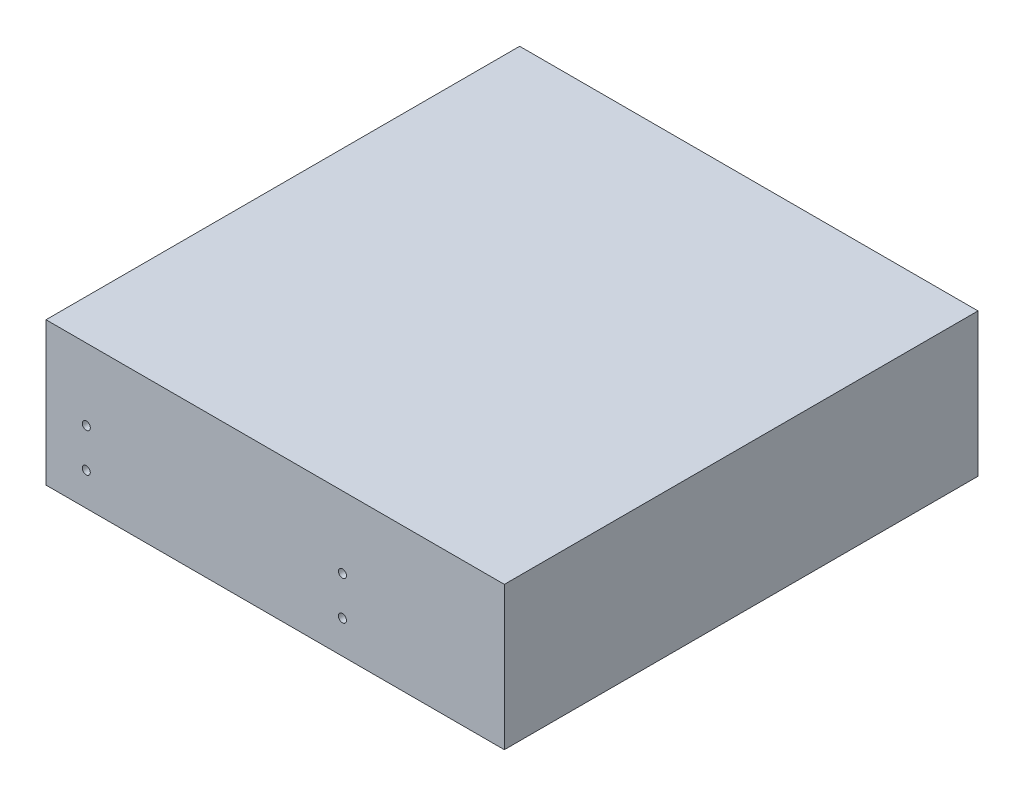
ISO-10303-21;
HEADER;
FILE_DESCRIPTION(('STEP AP214'),'2;1');
FILE_NAME('part.step','',(''),(''),'','','');
FILE_SCHEMA(('AUTOMOTIVE_DESIGN { 1 0 10303 214 1 1 1 1 }'));
ENDSEC;
DATA;
#1=APPLICATION_CONTEXT('core data for automotive mechanical design processes');
#2=APPLICATION_PROTOCOL_DEFINITION('international standard','automotive_design',2000,#1);
#3=PRODUCT_CONTEXT('',#1,'mechanical');
#4=PRODUCT('Part','Part','',(#3));
#5=PRODUCT_RELATED_PRODUCT_CATEGORY('part','',(#4));
#6=PRODUCT_DEFINITION_FORMATION('','',#4);
#7=PRODUCT_DEFINITION_CONTEXT('part definition',#1,'design');
#8=PRODUCT_DEFINITION('design','',#6,#7);
#9=PRODUCT_DEFINITION_SHAPE('','',#8);
#10=(LENGTH_UNIT() NAMED_UNIT(*) SI_UNIT(.MILLI.,.METRE.));
#11=(NAMED_UNIT(*) PLANE_ANGLE_UNIT() SI_UNIT($,.RADIAN.));
#12=(NAMED_UNIT(*) SI_UNIT($,.STERADIAN.) SOLID_ANGLE_UNIT());
#13=UNCERTAINTY_MEASURE_WITH_UNIT(LENGTH_MEASURE(1.E-05),#10,'distance_accuracy_value','');
#14=(GEOMETRIC_REPRESENTATION_CONTEXT(3) GLOBAL_UNCERTAINTY_ASSIGNED_CONTEXT((#13)) GLOBAL_UNIT_ASSIGNED_CONTEXT((#10,
#11,#12)) REPRESENTATION_CONTEXT('',''));
#15=CARTESIAN_POINT('',(0.,0.,0.));
#16=DIRECTION('',(0.,0.,1.));
#17=DIRECTION('',(1.,0.,0.));
#18=AXIS2_PLACEMENT_3D('',#15,#16,#17);
#19=CARTESIAN_POINT('',(-92.,0.,147.));
#20=DIRECTION('',(1.,0.,0.));
#21=DIRECTION('',(0.,0.,-1.));
#22=AXIS2_PLACEMENT_3D('',#19,#20,#21);
#23=PLANE('',#22);
#24=DIRECTION('',(0.,-1.,0.));
#25=VECTOR('',#24,1.);
#26=CARTESIAN_POINT('',(-92.,0.,0.));
#27=LINE('',#26,#25);
#28=CARTESIAN_POINT('',(-92.,22.2,0.));
#29=VERTEX_POINT('',#28);
#30=CARTESIAN_POINT('',(-92.,-22.25,0.));
#31=VERTEX_POINT('',#30);
#32=EDGE_CURVE('E110',#29,#31,#27,.T.);
#33=ORIENTED_EDGE('',*,*,#32,.T.);
#34=DIRECTION('',(0.,0.,-1.));
#35=VECTOR('',#34,1.);
#36=CARTESIAN_POINT('',(-92.,-22.25,147.));
#37=LINE('',#36,#35);
#38=CARTESIAN_POINT('',(-92.,-22.25,147.));
#39=VERTEX_POINT('',#38);
#40=EDGE_CURVE('E11',#39,#31,#37,.T.);
#41=ORIENTED_EDGE('',*,*,#40,.F.);
#42=DIRECTION('',(0.,-1.,0.));
#43=VECTOR('',#42,1.);
#44=CARTESIAN_POINT('',(-92.,0.,147.));
#45=LINE('',#44,#43);
#46=CARTESIAN_POINT('',(-92.,22.2,147.));
#47=VERTEX_POINT('',#46);
#48=EDGE_CURVE('E84',#47,#39,#45,.T.);
#49=ORIENTED_EDGE('',*,*,#48,.F.);
#50=DIRECTION('',(0.,0.,-1.));
#51=VECTOR('',#50,1.);
#52=CARTESIAN_POINT('',(-92.,22.2,147.));
#53=LINE('',#52,#51);
#54=EDGE_CURVE('E50',#47,#29,#53,.T.);
#55=ORIENTED_EDGE('',*,*,#54,.T.);
#56=EDGE_LOOP('',(#33,#41,#49,#55));
#57=FACE_BOUND('',#56,.T.);
#58=ADVANCED_FACE('F34',(#57),#23,.F.);
#59=CARTESIAN_POINT('',(0.,-22.25,147.));
#60=DIRECTION('',(0.,1.,0.));
#61=DIRECTION('',(0.,0.,1.));
#62=AXIS2_PLACEMENT_3D('',#59,#60,#61);
#63=PLANE('',#62);
#64=DIRECTION('',(1.,0.,0.));
#65=VECTOR('',#64,1.);
#66=CARTESIAN_POINT('',(0.,-22.25,0.));
#67=LINE('',#66,#65);
#68=CARTESIAN_POINT('',(50.25,-22.25,0.));
#69=VERTEX_POINT('',#68);
#70=EDGE_CURVE('E89',#31,#69,#67,.T.);
#71=ORIENTED_EDGE('',*,*,#70,.T.);
#72=DIRECTION('',(0.,0.,-1.));
#73=VECTOR('',#72,1.);
#74=CARTESIAN_POINT('',(50.25,-22.25,147.));
#75=LINE('',#74,#73);
#76=CARTESIAN_POINT('',(50.25,-22.25,147.));
#77=VERTEX_POINT('',#76);
#78=EDGE_CURVE('E42',#77,#69,#75,.T.);
#79=ORIENTED_EDGE('',*,*,#78,.F.);
#80=DIRECTION('',(1.,0.,0.));
#81=VECTOR('',#80,1.);
#82=CARTESIAN_POINT('',(0.,-22.25,147.));
#83=LINE('',#82,#81);
#84=EDGE_CURVE('E75',#39,#77,#83,.T.);
#85=ORIENTED_EDGE('',*,*,#84,.F.);
#86=ORIENTED_EDGE('',*,*,#40,.T.);
#87=EDGE_LOOP('',(#71,#79,#85,#86));
#88=FACE_BOUND('',#87,.T.);
#89=ADVANCED_FACE('F88',(#88),#63,.F.);
#90=CARTESIAN_POINT('',(50.25,0.,147.));
#91=DIRECTION('',(1.,0.,0.));
#92=DIRECTION('',(0.,1.,0.));
#93=AXIS2_PLACEMENT_3D('',#90,#91,#92);
#94=PLANE('',#93);
#95=DIRECTION('',(0.,-1.,0.));
#96=VECTOR('',#95,1.);
#97=CARTESIAN_POINT('',(50.25,0.,0.));
#98=LINE('',#97,#96);
#99=CARTESIAN_POINT('',(50.25,22.2,0.));
#100=VERTEX_POINT('',#99);
#101=EDGE_CURVE('E113',#100,#69,#98,.T.);
#102=ORIENTED_EDGE('',*,*,#101,.F.);
#103=DIRECTION('',(0.,0.,-1.));
#104=VECTOR('',#103,1.);
#105=CARTESIAN_POINT('',(50.25,22.2,147.));
#106=LINE('',#105,#104);
#107=CARTESIAN_POINT('',(50.25,22.2,147.));
#108=VERTEX_POINT('',#107);
#109=EDGE_CURVE('E64',#108,#100,#106,.T.);
#110=ORIENTED_EDGE('',*,*,#109,.F.);
#111=DIRECTION('',(0.,-1.,0.));
#112=VECTOR('',#111,1.);
#113=CARTESIAN_POINT('',(50.25,0.,147.));
#114=LINE('',#113,#112);
#115=EDGE_CURVE('E83',#108,#77,#114,.T.);
#116=ORIENTED_EDGE('',*,*,#115,.T.);
#117=ORIENTED_EDGE('',*,*,#78,.T.);
#118=EDGE_LOOP('',(#102,#110,#116,#117));
#119=FACE_BOUND('',#118,.T.);
#120=ADVANCED_FACE('F92',(#119),#94,.T.);
#121=CARTESIAN_POINT('',(-79.5,0.,147.));
#122=DIRECTION('',(0.,0.,-1.));
#123=DIRECTION('',(-1.,0.,0.));
#124=AXIS2_PLACEMENT_3D('',#121,#122,#123);
#125=CYLINDRICAL_SURFACE('',#124,1.25);
#126=CARTESIAN_POINT('',(-79.5,0.,147.));
#127=DIRECTION('',(0.,0.,1.));
#128=DIRECTION('',(1.,0.,0.));
#129=AXIS2_PLACEMENT_3D('',#126,#127,#128);
#130=CIRCLE('',#129,1.25);
#131=CARTESIAN_POINT('',(-78.25,0.,147.));
#132=VERTEX_POINT('',#131);
#133=EDGE_CURVE('E104',#132,#132,#130,.T.);
#134=ORIENTED_EDGE('',*,*,#133,.T.);
#135=EDGE_LOOP('',(#134));
#136=FACE_BOUND('',#135,.T.);
#137=CARTESIAN_POINT('',(-79.5,0.,0.));
#138=DIRECTION('',(0.,0.,1.));
#139=DIRECTION('',(1.,0.,0.));
#140=AXIS2_PLACEMENT_3D('',#137,#138,#139);
#141=CIRCLE('',#140,1.25);
#142=CARTESIAN_POINT('',(-78.25,0.,0.));
#143=VERTEX_POINT('',#142);
#144=EDGE_CURVE('E124',#143,#143,#141,.T.);
#145=ORIENTED_EDGE('',*,*,#144,.F.);
#146=EDGE_LOOP('',(#145));
#147=FACE_BOUND('',#146,.T.);
#148=ADVANCED_FACE('F162',(#136,#147),#125,.F.);
#149=CARTESIAN_POINT('',(-79.5,-12.,147.));
#150=DIRECTION('',(0.,0.,-1.));
#151=DIRECTION('',(-1.,0.,0.));
#152=AXIS2_PLACEMENT_3D('',#149,#150,#151);
#153=CYLINDRICAL_SURFACE('',#152,1.25);
#154=CARTESIAN_POINT('',(-79.5,-12.,147.));
#155=DIRECTION('',(0.,0.,1.));
#156=DIRECTION('',(1.,0.,0.));
#157=AXIS2_PLACEMENT_3D('',#154,#155,#156);
#158=CIRCLE('',#157,1.25);
#159=CARTESIAN_POINT('',(-78.25,-12.,147.));
#160=VERTEX_POINT('',#159);
#161=EDGE_CURVE('E101',#160,#160,#158,.T.);
#162=ORIENTED_EDGE('',*,*,#161,.T.);
#163=EDGE_LOOP('',(#162));
#164=FACE_BOUND('',#163,.T.);
#165=CARTESIAN_POINT('',(-79.5,-12.,0.));
#166=DIRECTION('',(0.,0.,1.));
#167=DIRECTION('',(1.,0.,0.));
#168=AXIS2_PLACEMENT_3D('',#165,#166,#167);
#169=CIRCLE('',#168,1.25);
#170=CARTESIAN_POINT('',(-78.25,-12.,0.));
#171=VERTEX_POINT('',#170);
#172=EDGE_CURVE('E121',#171,#171,#169,.T.);
#173=ORIENTED_EDGE('',*,*,#172,.F.);
#174=EDGE_LOOP('',(#173));
#175=FACE_BOUND('',#174,.T.);
#176=ADVANCED_FACE('F164',(#164,#175),#153,.F.);
#177=CARTESIAN_POINT('',(0.,-12.,147.));
#178=DIRECTION('',(0.,0.,-1.));
#179=DIRECTION('',(-1.,0.,0.));
#180=AXIS2_PLACEMENT_3D('',#177,#178,#179);
#181=CYLINDRICAL_SURFACE('',#180,1.25);
#182=CARTESIAN_POINT('',(0.,-12.,147.));
#183=DIRECTION('',(0.,0.,1.));
#184=DIRECTION('',(1.,0.,0.));
#185=AXIS2_PLACEMENT_3D('',#182,#183,#184);
#186=CIRCLE('',#185,1.25);
#187=CARTESIAN_POINT('',(1.25,-12.,147.));
#188=VERTEX_POINT('',#187);
#189=EDGE_CURVE('E95',#188,#188,#186,.T.);
#190=ORIENTED_EDGE('',*,*,#189,.T.);
#191=EDGE_LOOP('',(#190));
#192=FACE_BOUND('',#191,.T.);
#193=CARTESIAN_POINT('',(0.,-12.,0.));
#194=DIRECTION('',(0.,0.,1.));
#195=DIRECTION('',(1.,0.,0.));
#196=AXIS2_PLACEMENT_3D('',#193,#194,#195);
#197=CIRCLE('',#196,1.25);
#198=CARTESIAN_POINT('',(1.25,-12.,0.));
#199=VERTEX_POINT('',#198);
#200=EDGE_CURVE('E118',#199,#199,#197,.T.);
#201=ORIENTED_EDGE('',*,*,#200,.F.);
#202=EDGE_LOOP('',(#201));
#203=FACE_BOUND('',#202,.T.);
#204=ADVANCED_FACE('F145',(#192,#203),#181,.F.);
#205=CARTESIAN_POINT('',(0.,22.2,147.));
#206=DIRECTION('',(0.,1.,0.));
#207=DIRECTION('',(0.,0.,1.));
#208=AXIS2_PLACEMENT_3D('',#205,#206,#207);
#209=PLANE('',#208);
#210=DIRECTION('',(1.,0.,0.));
#211=VECTOR('',#210,1.);
#212=CARTESIAN_POINT('',(0.,22.2,0.));
#213=LINE('',#212,#211);
#214=EDGE_CURVE('E115',#29,#100,#213,.T.);
#215=ORIENTED_EDGE('',*,*,#214,.F.);
#216=ORIENTED_EDGE('',*,*,#54,.F.);
#217=DIRECTION('',(1.,0.,0.));
#218=VECTOR('',#217,1.);
#219=CARTESIAN_POINT('',(0.,22.2,147.));
#220=LINE('',#219,#218);
#221=EDGE_CURVE('E93',#47,#108,#220,.T.);
#222=ORIENTED_EDGE('',*,*,#221,.T.);
#223=ORIENTED_EDGE('',*,*,#109,.T.);
#224=EDGE_LOOP('',(#215,#216,#222,#223));
#225=FACE_BOUND('',#224,.T.);
#226=ADVANCED_FACE('F137',(#225),#209,.T.);
#227=CARTESIAN_POINT('',(0.,0.,147.));
#228=DIRECTION('',(0.,0.,-1.));
#229=DIRECTION('',(-1.,0.,0.));
#230=AXIS2_PLACEMENT_3D('',#227,#228,#229);
#231=CYLINDRICAL_SURFACE('',#230,1.25);
#232=CARTESIAN_POINT('',(0.,0.,147.));
#233=DIRECTION('',(0.,0.,1.));
#234=DIRECTION('',(1.,0.,0.));
#235=AXIS2_PLACEMENT_3D('',#232,#233,#234);
#236=CIRCLE('',#235,1.25);
#237=CARTESIAN_POINT('',(1.25,0.,147.));
#238=VERTEX_POINT('',#237);
#239=EDGE_CURVE('E107',#238,#238,#236,.T.);
#240=ORIENTED_EDGE('',*,*,#239,.T.);
#241=EDGE_LOOP('',(#240));
#242=FACE_BOUND('',#241,.T.);
#243=CARTESIAN_POINT('',(0.,0.,0.));
#244=DIRECTION('',(0.,0.,1.));
#245=DIRECTION('',(1.,0.,0.));
#246=AXIS2_PLACEMENT_3D('',#243,#244,#245);
#247=CIRCLE('',#246,1.25);
#248=CARTESIAN_POINT('',(1.25,0.,0.));
#249=VERTEX_POINT('',#248);
#250=EDGE_CURVE('E127',#249,#249,#247,.T.);
#251=ORIENTED_EDGE('',*,*,#250,.F.);
#252=EDGE_LOOP('',(#251));
#253=FACE_BOUND('',#252,.T.);
#254=ADVANCED_FACE('F135',(#242,#253),#231,.F.);
#255=CARTESIAN_POINT('',(0.,0.,147.));
#256=DIRECTION('',(0.,0.,1.));
#257=DIRECTION('',(1.,0.,0.));
#258=AXIS2_PLACEMENT_3D('',#255,#256,#257);
#259=PLANE('',#258);
#260=ORIENTED_EDGE('',*,*,#48,.T.);
#261=ORIENTED_EDGE('',*,*,#84,.T.);
#262=ORIENTED_EDGE('',*,*,#115,.F.);
#263=ORIENTED_EDGE('',*,*,#221,.F.);
#264=EDGE_LOOP('',(#260,#261,#262,#263));
#265=FACE_BOUND('',#264,.T.);
#266=ORIENTED_EDGE('',*,*,#189,.F.);
#267=EDGE_LOOP('',(#266));
#268=FACE_BOUND('',#267,.T.);
#269=ORIENTED_EDGE('',*,*,#161,.F.);
#270=EDGE_LOOP('',(#269));
#271=FACE_BOUND('',#270,.T.);
#272=ORIENTED_EDGE('',*,*,#133,.F.);
#273=EDGE_LOOP('',(#272));
#274=FACE_BOUND('',#273,.T.);
#275=ORIENTED_EDGE('',*,*,#239,.F.);
#276=EDGE_LOOP('',(#275));
#277=FACE_BOUND('',#276,.T.);
#278=ADVANCED_FACE('F79',(#265,#268,#271,#274,#277),#259,.T.);
#279=CARTESIAN_POINT('',(0.,0.,0.));
#280=DIRECTION('',(0.,0.,1.));
#281=DIRECTION('',(1.,0.,0.));
#282=AXIS2_PLACEMENT_3D('',#279,#280,#281);
#283=PLANE('',#282);
#284=ORIENTED_EDGE('',*,*,#32,.F.);
#285=ORIENTED_EDGE('',*,*,#214,.T.);
#286=ORIENTED_EDGE('',*,*,#101,.T.);
#287=ORIENTED_EDGE('',*,*,#70,.F.);
#288=EDGE_LOOP('',(#284,#285,#286,#287));
#289=FACE_BOUND('',#288,.T.);
#290=ORIENTED_EDGE('',*,*,#200,.T.);
#291=EDGE_LOOP('',(#290));
#292=FACE_BOUND('',#291,.T.);
#293=ORIENTED_EDGE('',*,*,#172,.T.);
#294=EDGE_LOOP('',(#293));
#295=FACE_BOUND('',#294,.T.);
#296=ORIENTED_EDGE('',*,*,#144,.T.);
#297=EDGE_LOOP('',(#296));
#298=FACE_BOUND('',#297,.T.);
#299=ORIENTED_EDGE('',*,*,#250,.T.);
#300=EDGE_LOOP('',(#299));
#301=FACE_BOUND('',#300,.T.);
#302=ADVANCED_FACE('F133',(#289,#292,#295,#298,#301),#283,.F.);
#303=CLOSED_SHELL('',(#58,#89,#120,#148,#176,#204,#226,#254,#278,#302));
#304=MANIFOLD_SOLID_BREP('B2',#303);
#305=ADVANCED_BREP_SHAPE_REPRESENTATION('',(#18,#304),#14);
#306=SHAPE_DEFINITION_REPRESENTATION(#9,#305);
ENDSEC;
END-ISO-10303-21;
